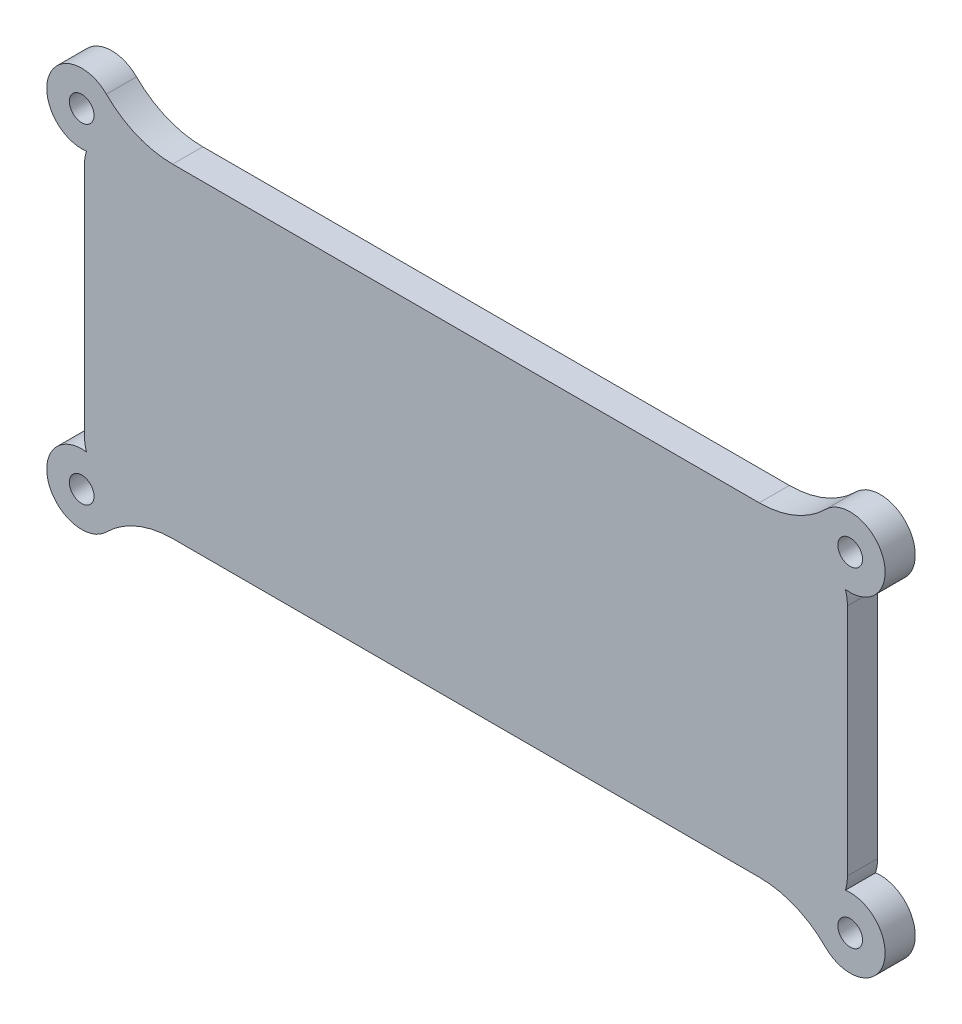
from build123d import *

# Parameters (mm, degrees)
SKETCH1_R           = 2.0828
BOSS_EXTRUDE1_DEPTH = 5.08
SKETCH2_R           = 4.5
BOSS_EXTRUDE2_DEPTH = 1.778


with BuildPart() as part:
    # Sketch1 → Boss-Extrude1 (new body)
    with BuildSketch(Plane.XY):
        with BuildLine():
            Line((-127.636468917, -9.671982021), (-127.636468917, 29.788017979))
            add(Edge.make_bspline(
                [(-127.636468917, 29.788017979), (-127.636468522, 30.261041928), (-127.563411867, 31.025866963), (-127.386048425, 31.748160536), (-127.298569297, 32.03202242)],
                knots=[0.51130066, 0.51130066, 0.51130066, 0.51130066, 0.517169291, 0.521126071, 0.521126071, 0.521126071, 0.521126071], degree=3))
            ThreePointArc((-127.298569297, 32.03202242), (-133.683771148, 39.749627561), (-123.931860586, 42.037087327))
            ThreePointArc((-123.931860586, 42.037087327), (-118.804469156, 38.611073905), (-112.756298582, 37.408017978))
            Line((-112.756298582, 37.408017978), (-13.805399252, 37.408017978))
            ThreePointArc((-13.805399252, 37.408017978), (-7.757228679, 38.611073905), (-2.629837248, 42.037087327))
            ThreePointArc((-2.629837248, 42.037087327), (7.122064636, 39.749653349), (0.736925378, 32.032015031))
            add(Edge.make_bspline(
                [(1.074771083, 29.788017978), (1.074768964, 30.82989688), (0.794869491, 31.834337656), (0.767178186, 31.933710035), (0.736925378, 32.032015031)],
                knots=[0, 0, 0, 0.25, 0.25, 0.275715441, 0.275715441, 0.275715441], degree=2))
            Line((1.074771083, 29.788017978), (1.074771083, -9.671982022))
            add(Edge.make_bspline(
                [(1.074771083, -9.671982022), (1.074770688, -10.145005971), (1.001714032, -10.909831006), (0.82435059, -11.632124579), (0.736871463, -11.915986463)],
                knots=[0.01130066, 0.01130066, 0.01130066, 0.01130066, 0.017169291, 0.021126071, 0.021126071, 0.021126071, 0.021126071], degree=3))
            ThreePointArc((0.736871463, -11.915986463), (7.122073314, -19.633591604), (-2.629837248, -21.921051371))
            ThreePointArc((-2.629837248, -21.921051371), (-7.757228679, -18.495037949), (-13.805399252, -17.291982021))
            Line((-13.805399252, -17.291982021), (-112.756298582, -17.291982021))
            ThreePointArc((-112.756298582, -17.291982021), (-118.804469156, -18.495037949), (-123.931860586, -21.921051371))
            ThreePointArc((-123.931860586, -21.921051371), (-133.68376247, -19.633617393), (-127.298623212, -11.915979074))
            add(Edge.make_bspline(
                [(-127.636468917, -9.671982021), (-127.636466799, -10.713860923), (-127.356567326, -11.718301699), (-127.32887602, -11.817674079), (-127.298623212, -11.915979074)],
                knots=[0, 0, 0, 0.25, 0.25, 0.275715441, 0.275715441, 0.275715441], degree=2))
        make_face()
        with Locations((1.537001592, -17.75421253)):
            Circle(SKETCH1_R, mode=Mode.SUBTRACT)
        with Locations((1.537001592, 37.870248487)):
            Circle(SKETCH1_R, mode=Mode.SUBTRACT)
        with Locations((-128.098699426, -17.75421253)):
            Circle(SKETCH1_R, mode=Mode.SUBTRACT)
        with Locations((-128.098699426, 37.870248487)):
            Circle(SKETCH1_R, mode=Mode.SUBTRACT)
    extrude(amount=BOSS_EXTRUDE1_DEPTH)

    # Sketch2 → Boss-Extrude2 (add)
    with BuildSketch(Plane(origin=(0, 0, 0), x_dir=(-1, 0, 0), z_dir=(0, 0, -1))):
        with Locations(Location((26.275228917, 10.058017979, 0), (0, 0, 180))):
            Circle(SKETCH2_R)
        Polygon((54.895228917, 15.138017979), (54.895228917, 29.788017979), (120.016468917, 29.788017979), (120.016468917, -9.671982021), (54.895228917, -9.671982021), (54.895228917, 4.978017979), (53.625228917, 4.978017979), (53.625228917, -10.941982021), (121.286468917, -10.941982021), (121.286468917, 31.058017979), (53.625228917, 31.058017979), (53.625228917, 15.138017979), align=None)
    extrude(amount=BOSS_EXTRUDE2_DEPTH)


solid = part.part
